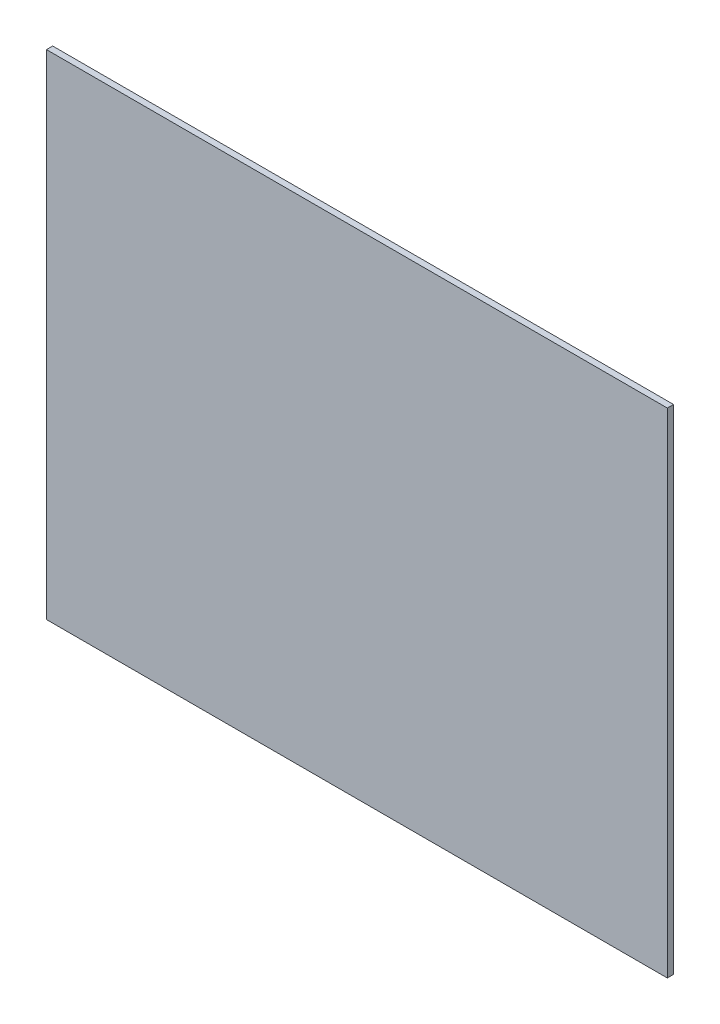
ISO-10303-21;
HEADER;
FILE_DESCRIPTION(('STEP AP214'),'2;1');
FILE_NAME('part.step','',(''),(''),'','','');
FILE_SCHEMA(('AUTOMOTIVE_DESIGN { 1 0 10303 214 1 1 1 1 }'));
ENDSEC;
DATA;
#1=APPLICATION_CONTEXT('core data for automotive mechanical design processes');
#2=APPLICATION_PROTOCOL_DEFINITION('international standard','automotive_design',2000,#1);
#3=PRODUCT_CONTEXT('',#1,'mechanical');
#4=PRODUCT('Part','Part','',(#3));
#5=PRODUCT_RELATED_PRODUCT_CATEGORY('part','',(#4));
#6=PRODUCT_DEFINITION_FORMATION('','',#4);
#7=PRODUCT_DEFINITION_CONTEXT('part definition',#1,'design');
#8=PRODUCT_DEFINITION('design','',#6,#7);
#9=PRODUCT_DEFINITION_SHAPE('','',#8);
#10=(LENGTH_UNIT() NAMED_UNIT(*) SI_UNIT(.MILLI.,.METRE.));
#11=(NAMED_UNIT(*) PLANE_ANGLE_UNIT() SI_UNIT($,.RADIAN.));
#12=(NAMED_UNIT(*) SI_UNIT($,.STERADIAN.) SOLID_ANGLE_UNIT());
#13=UNCERTAINTY_MEASURE_WITH_UNIT(LENGTH_MEASURE(1.E-05),#10,'distance_accuracy_value','');
#14=(GEOMETRIC_REPRESENTATION_CONTEXT(3) GLOBAL_UNCERTAINTY_ASSIGNED_CONTEXT((#13)) GLOBAL_UNIT_ASSIGNED_CONTEXT((#10,
#11,#12)) REPRESENTATION_CONTEXT('',''));
#15=CARTESIAN_POINT('',(0.,0.,0.));
#16=DIRECTION('',(0.,0.,1.));
#17=DIRECTION('',(1.,0.,0.));
#18=AXIS2_PLACEMENT_3D('',#15,#16,#17);
#19=CARTESIAN_POINT('',(0.,0.,10.));
#20=DIRECTION('',(1.,0.,0.));
#21=DIRECTION('',(0.,0.,-1.));
#22=AXIS2_PLACEMENT_3D('',#19,#20,#21);
#23=PLANE('',#22);
#24=DIRECTION('',(0.,-1.,0.));
#25=VECTOR('',#24,1.);
#26=CARTESIAN_POINT('',(0.,0.,0.));
#27=LINE('',#26,#25);
#28=CARTESIAN_POINT('',(0.,795.,0.));
#29=VERTEX_POINT('',#28);
#30=CARTESIAN_POINT('',(0.,0.,0.));
#31=VERTEX_POINT('',#30);
#32=EDGE_CURVE('E81',#29,#31,#27,.T.);
#33=ORIENTED_EDGE('',*,*,#32,.T.);
#34=DIRECTION('',(0.,0.,-1.));
#35=VECTOR('',#34,1.);
#36=CARTESIAN_POINT('',(0.,0.,10.));
#37=LINE('',#36,#35);
#38=CARTESIAN_POINT('',(0.,0.,10.));
#39=VERTEX_POINT('',#38);
#40=EDGE_CURVE('E11',#39,#31,#37,.T.);
#41=ORIENTED_EDGE('',*,*,#40,.F.);
#42=DIRECTION('',(0.,-1.,0.));
#43=VECTOR('',#42,1.);
#44=CARTESIAN_POINT('',(0.,0.,10.));
#45=LINE('',#44,#43);
#46=CARTESIAN_POINT('',(0.,795.,10.));
#47=VERTEX_POINT('',#46);
#48=EDGE_CURVE('E104',#47,#39,#45,.T.);
#49=ORIENTED_EDGE('',*,*,#48,.F.);
#50=DIRECTION('',(0.,0.,-1.));
#51=VECTOR('',#50,1.);
#52=CARTESIAN_POINT('',(0.,795.,10.));
#53=LINE('',#52,#51);
#54=EDGE_CURVE('E94',#47,#29,#53,.T.);
#55=ORIENTED_EDGE('',*,*,#54,.T.);
#56=EDGE_LOOP('',(#33,#41,#49,#55));
#57=FACE_BOUND('',#56,.T.);
#58=ADVANCED_FACE('F36',(#57),#23,.F.);
#59=CARTESIAN_POINT('',(0.,0.,10.));
#60=DIRECTION('',(0.,1.,0.));
#61=DIRECTION('',(0.,0.,1.));
#62=AXIS2_PLACEMENT_3D('',#59,#60,#61);
#63=PLANE('',#62);
#64=DIRECTION('',(1.,0.,0.));
#65=VECTOR('',#64,1.);
#66=CARTESIAN_POINT('',(0.,0.,0.));
#67=LINE('',#66,#65);
#68=CARTESIAN_POINT('',(1000.,0.,0.));
#69=VERTEX_POINT('',#68);
#70=EDGE_CURVE('E77',#31,#69,#67,.T.);
#71=ORIENTED_EDGE('',*,*,#70,.T.);
#72=DIRECTION('',(0.,0.,-1.));
#73=VECTOR('',#72,1.);
#74=CARTESIAN_POINT('',(1000.,0.,10.));
#75=LINE('',#74,#73);
#76=CARTESIAN_POINT('',(1000.,0.,10.));
#77=VERTEX_POINT('',#76);
#78=EDGE_CURVE('E44',#77,#69,#75,.T.);
#79=ORIENTED_EDGE('',*,*,#78,.F.);
#80=DIRECTION('',(1.,0.,0.));
#81=VECTOR('',#80,1.);
#82=CARTESIAN_POINT('',(0.,0.,10.));
#83=LINE('',#82,#81);
#84=EDGE_CURVE('E90',#39,#77,#83,.T.);
#85=ORIENTED_EDGE('',*,*,#84,.F.);
#86=ORIENTED_EDGE('',*,*,#40,.T.);
#87=EDGE_LOOP('',(#71,#79,#85,#86));
#88=FACE_BOUND('',#87,.T.);
#89=ADVANCED_FACE('F89',(#88),#63,.F.);
#90=CARTESIAN_POINT('',(1000.,0.,10.));
#91=DIRECTION('',(-1.,0.,0.));
#92=DIRECTION('',(0.,0.,1.));
#93=AXIS2_PLACEMENT_3D('',#90,#91,#92);
#94=PLANE('',#93);
#95=DIRECTION('',(0.,1.,0.));
#96=VECTOR('',#95,1.);
#97=CARTESIAN_POINT('',(1000.,0.,0.));
#98=LINE('',#97,#96);
#99=CARTESIAN_POINT('',(1000.,795.,0.));
#100=VERTEX_POINT('',#99);
#101=EDGE_CURVE('E82',#69,#100,#98,.T.);
#102=ORIENTED_EDGE('',*,*,#101,.T.);
#103=DIRECTION('',(0.,0.,-1.));
#104=VECTOR('',#103,1.);
#105=CARTESIAN_POINT('',(1000.,795.,10.));
#106=LINE('',#105,#104);
#107=CARTESIAN_POINT('',(1000.,795.,10.));
#108=VERTEX_POINT('',#107);
#109=EDGE_CURVE('E115',#108,#100,#106,.T.);
#110=ORIENTED_EDGE('',*,*,#109,.F.);
#111=DIRECTION('',(0.,1.,0.));
#112=VECTOR('',#111,1.);
#113=CARTESIAN_POINT('',(1000.,0.,10.));
#114=LINE('',#113,#112);
#115=EDGE_CURVE('E56',#77,#108,#114,.T.);
#116=ORIENTED_EDGE('',*,*,#115,.F.);
#117=ORIENTED_EDGE('',*,*,#78,.T.);
#118=EDGE_LOOP('',(#102,#110,#116,#117));
#119=FACE_BOUND('',#118,.T.);
#120=ADVANCED_FACE('F119',(#119),#94,.F.);
#121=CARTESIAN_POINT('',(0.,795.,10.));
#122=DIRECTION('',(0.,-1.,0.));
#123=DIRECTION('',(0.,0.,-1.));
#124=AXIS2_PLACEMENT_3D('',#121,#122,#123);
#125=PLANE('',#124);
#126=DIRECTION('',(-1.,0.,0.));
#127=VECTOR('',#126,1.);
#128=CARTESIAN_POINT('',(0.,795.,0.));
#129=LINE('',#128,#127);
#130=EDGE_CURVE('E102',#100,#29,#129,.T.);
#131=ORIENTED_EDGE('',*,*,#130,.T.);
#132=ORIENTED_EDGE('',*,*,#54,.F.);
#133=DIRECTION('',(-1.,0.,0.));
#134=VECTOR('',#133,1.);
#135=CARTESIAN_POINT('',(0.,795.,10.));
#136=LINE('',#135,#134);
#137=EDGE_CURVE('E51',#108,#47,#136,.T.);
#138=ORIENTED_EDGE('',*,*,#137,.F.);
#139=ORIENTED_EDGE('',*,*,#109,.T.);
#140=EDGE_LOOP('',(#131,#132,#138,#139));
#141=FACE_BOUND('',#140,.T.);
#142=ADVANCED_FACE('F121',(#141),#125,.F.);
#143=CARTESIAN_POINT('',(0.,795.,10.));
#144=DIRECTION('',(0.,0.,-1.));
#145=DIRECTION('',(-1.,0.,0.));
#146=AXIS2_PLACEMENT_3D('',#143,#144,#145);
#147=PLANE('',#146);
#148=ORIENTED_EDGE('',*,*,#48,.T.);
#149=ORIENTED_EDGE('',*,*,#84,.T.);
#150=ORIENTED_EDGE('',*,*,#115,.T.);
#151=ORIENTED_EDGE('',*,*,#137,.T.);
#152=EDGE_LOOP('',(#148,#149,#150,#151));
#153=FACE_BOUND('',#152,.T.);
#154=ADVANCED_FACE('F122',(#153),#147,.F.);
#155=CARTESIAN_POINT('',(0.,795.,0.));
#156=DIRECTION('',(0.,0.,-1.));
#157=DIRECTION('',(-1.,0.,0.));
#158=AXIS2_PLACEMENT_3D('',#155,#156,#157);
#159=PLANE('',#158);
#160=ORIENTED_EDGE('',*,*,#32,.F.);
#161=ORIENTED_EDGE('',*,*,#130,.F.);
#162=ORIENTED_EDGE('',*,*,#101,.F.);
#163=ORIENTED_EDGE('',*,*,#70,.F.);
#164=EDGE_LOOP('',(#160,#161,#162,#163));
#165=FACE_BOUND('',#164,.T.);
#166=ADVANCED_FACE('F78',(#165),#159,.T.);
#167=CLOSED_SHELL('',(#58,#89,#120,#142,#154,#166));
#168=MANIFOLD_SOLID_BREP('B2',#167);
#169=ADVANCED_BREP_SHAPE_REPRESENTATION('',(#18,#168),#14);
#170=SHAPE_DEFINITION_REPRESENTATION(#9,#169);
ENDSEC;
END-ISO-10303-21;
